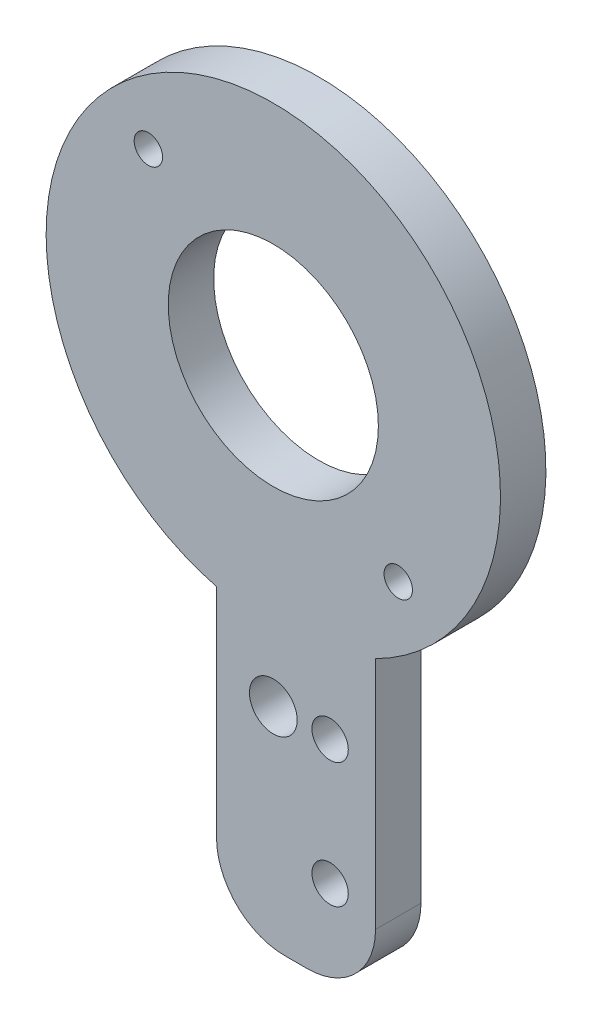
from build123d import *

# Parameters (mm, degrees)
ESQUISSE1_R                     = 9.25
BOSS_EXTRU_1_DEPTH              = 4
DIAM_TRE_DU_PER_AGE_3_2_3_2_1_D = 3.2
DIAM_TRE_DU_PER_AGE_4_2_4_2_1_D = 4.2
TROU_TARAUD_M31_D               = 2.5


with BuildPart() as part:
    # Esquisse1 → Boss.-Extru.1 (new body)
    with BuildSketch(Plane.XY):
        with BuildLine():
            Line((-5, -19.364916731), (-5, -38.5))
            ThreePointArc((-5, -38.5), (-3.242640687, -42.742640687), (1, -44.5))
            Line((1, -44.5), (3, -44.5))
            ThreePointArc((3, -44.5), (7.242640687, -42.742640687), (9, -38.5))
            Line((9, -38.5), (9, -17.860571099))
            ThreePointArc((9, -17.860571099), (-2.136764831, 19.885528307), (-5, -19.364916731))
        make_face()
        Circle(ESQUISSE1_R, mode=Mode.SUBTRACT)
    extrude(amount=BOSS_EXTRU_1_DEPTH)

    # Diam_tre du per_age _3.2 _3.2_1 (through all)
    with Locations(Plane.XY.offset(4)):
        with Locations((5, -26), (5, -37)):
            Hole(DIAM_TRE_DU_PER_AGE_3_2_3_2_1_D / 2)

    # Diam_tre du per_age _4.2 _4.2_1 (through all)
    with Locations(Plane.XY.offset(4)):
        with Locations((0, -26)):
            Hole(DIAM_TRE_DU_PER_AGE_4_2_4_2_1_D / 2)

    # Trou taraud_ M31 (through all)
    with Locations(Plane.XY.offset(4)):
        with Locations((-11, 11), (11, -11)):
            Hole(TROU_TARAUD_M31_D / 2)


solid = part.part
